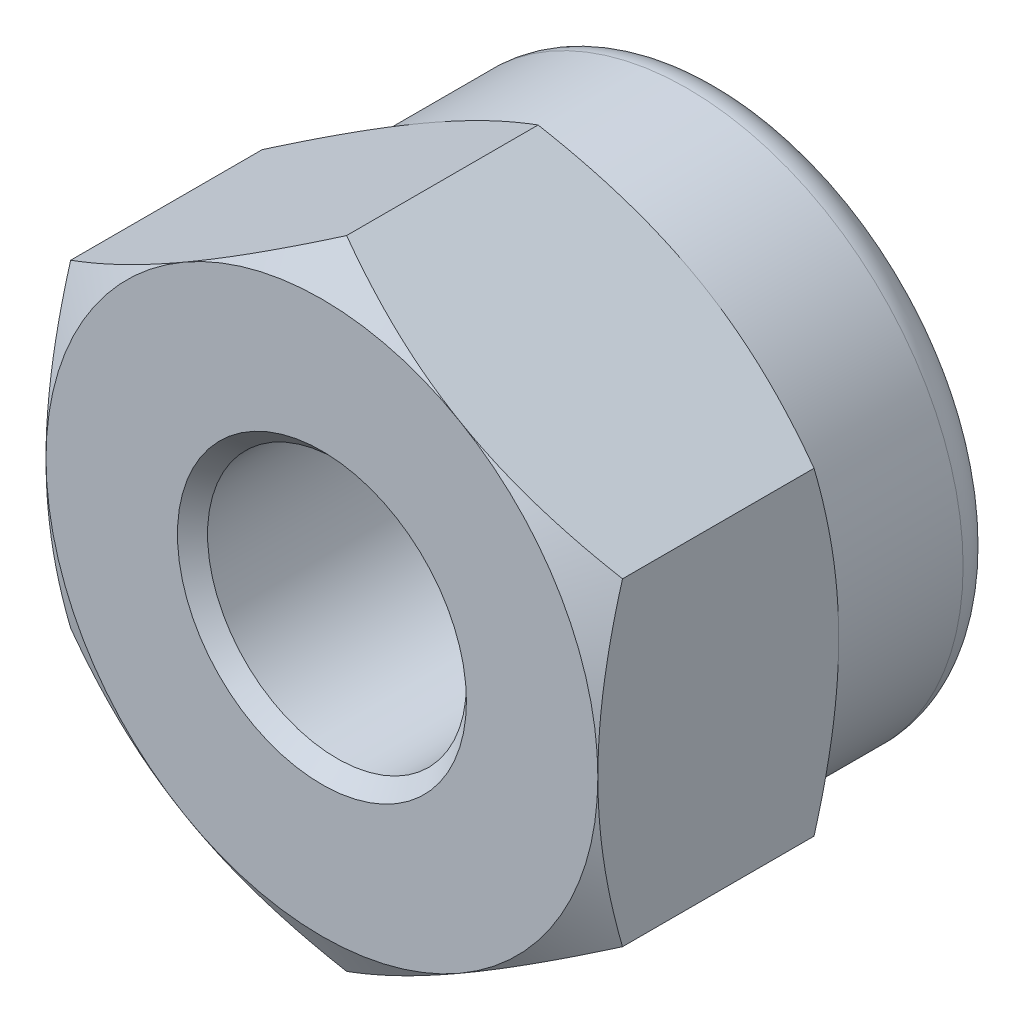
ISO-10303-21;
HEADER;
FILE_DESCRIPTION(('STEP AP214'),'2;1');
FILE_NAME('part.step','',(''),(''),'','','');
FILE_SCHEMA(('AUTOMOTIVE_DESIGN { 1 0 10303 214 1 1 1 1 }'));
ENDSEC;
DATA;
#1=APPLICATION_CONTEXT('core data for automotive mechanical design processes');
#2=APPLICATION_PROTOCOL_DEFINITION('international standard','automotive_design',2000,#1);
#3=PRODUCT_CONTEXT('',#1,'mechanical');
#4=PRODUCT('Part','Part','',(#3));
#5=PRODUCT_RELATED_PRODUCT_CATEGORY('part','',(#4));
#6=PRODUCT_DEFINITION_FORMATION('','',#4);
#7=PRODUCT_DEFINITION_CONTEXT('part definition',#1,'design');
#8=PRODUCT_DEFINITION('design','',#6,#7);
#9=PRODUCT_DEFINITION_SHAPE('','',#8);
#10=(LENGTH_UNIT() NAMED_UNIT(*) SI_UNIT(.MILLI.,.METRE.));
#11=(NAMED_UNIT(*) PLANE_ANGLE_UNIT() SI_UNIT($,.RADIAN.));
#12=(NAMED_UNIT(*) SI_UNIT($,.STERADIAN.) SOLID_ANGLE_UNIT());
#13=UNCERTAINTY_MEASURE_WITH_UNIT(LENGTH_MEASURE(1.E-05),#10,'distance_accuracy_value','');
#14=(GEOMETRIC_REPRESENTATION_CONTEXT(3) GLOBAL_UNCERTAINTY_ASSIGNED_CONTEXT((#13)) GLOBAL_UNIT_ASSIGNED_CONTEXT((#10,
#11,#12)) REPRESENTATION_CONTEXT('',''));
#15=CARTESIAN_POINT('',(0.,0.,0.));
#16=DIRECTION('',(0.,0.,1.));
#17=DIRECTION('',(1.,0.,0.));
#18=AXIS2_PLACEMENT_3D('',#15,#16,#17);
#19=CARTESIAN_POINT('',(0.,0.,-4.));
#20=DIRECTION('',(0.,0.,1.));
#21=DIRECTION('',(1.,0.,0.));
#22=AXIS2_PLACEMENT_3D('',#19,#20,#21);
#23=CYLINDRICAL_SURFACE('',#22,1.65);
#24=CARTESIAN_POINT('',(0.,0.,-2.4));
#25=DIRECTION('',(0.,0.,-1.));
#26=DIRECTION('',(-1.,0.,0.));
#27=AXIS2_PLACEMENT_3D('',#24,#25,#26);
#28=CIRCLE('',#27,1.65);
#29=CARTESIAN_POINT('',(-1.65,0.,-2.4));
#30=VERTEX_POINT('',#29);
#31=EDGE_CURVE('E324',#30,#30,#28,.T.);
#32=ORIENTED_EDGE('',*,*,#31,.F.);
#33=EDGE_LOOP('',(#32));
#34=FACE_BOUND('',#33,.T.);
#35=CARTESIAN_POINT('',(0.,0.,-3.6));
#36=DIRECTION('',(0.,0.,-1.));
#37=DIRECTION('',(-1.,0.,0.));
#38=AXIS2_PLACEMENT_3D('',#35,#36,#37);
#39=CIRCLE('',#38,1.65);
#40=CARTESIAN_POINT('',(-1.65,0.,-3.6));
#41=VERTEX_POINT('',#40);
#42=EDGE_CURVE('E321',#41,#41,#39,.T.);
#43=ORIENTED_EDGE('',*,*,#42,.T.);
#44=EDGE_LOOP('',(#43));
#45=FACE_BOUND('',#44,.T.);
#46=ADVANCED_FACE('F40',(#34,#45),#23,.F.);
#47=CARTESIAN_POINT('',(2.75,1.58771324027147,-2.4));
#48=DIRECTION('',(0.5,0.866025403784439,0.));
#49=DIRECTION('',(-0.866025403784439,0.5,0.));
#50=AXIS2_PLACEMENT_3D('',#47,#48,#49);
#51=PLANE('',#50);
#52=DIRECTION('',(0.,0.,1.));
#53=VECTOR('',#52,1.);
#54=CARTESIAN_POINT('',(2.75,1.58771324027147,-2.4));
#55=LINE('',#54,#53);
#56=CARTESIAN_POINT('',(2.75,1.58771324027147,-2.15437990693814));
#57=VERTEX_POINT('',#56);
#58=CARTESIAN_POINT('',(2.75,1.58771324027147,-0.245620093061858));
#59=VERTEX_POINT('',#58);
#60=EDGE_CURVE('E500',#57,#59,#55,.T.);
#61=ORIENTED_EDGE('',*,*,#60,.F.);
#62=CARTESIAN_POINT('',(2.7502,1.58759777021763,-2.15431323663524));
#63=CARTESIAN_POINT('',(2.62935077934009,1.65737010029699,-2.19461233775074));
#64=CARTESIAN_POINT('',(2.50745839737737,1.72774469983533,-2.23126309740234));
#65=CARTESIAN_POINT('',(2.26156287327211,1.86971254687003,-2.2952378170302));
#66=CARTESIAN_POINT('',(2.13755536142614,1.94130831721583,-2.3225391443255));
#67=CARTESIAN_POINT('',(1.89107720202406,2.08361254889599,-2.36503825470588));
#68=CARTESIAN_POINT('',(1.76864448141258,2.15429911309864,-2.38051888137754));
#69=CARTESIAN_POINT('',(1.52320285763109,2.29600490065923,-2.39900060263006));
#70=CARTESIAN_POINT('',(1.40019484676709,2.36702360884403,-2.4020170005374));
#71=CARTESIAN_POINT('',(1.17034121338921,2.49972966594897,-2.39574685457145));
#72=CARTESIAN_POINT('',(1.06346120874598,2.56143686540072,-2.3879998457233));
#73=CARTESIAN_POINT('',(0.850397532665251,2.68444923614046,-2.36344481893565));
#74=CARTESIAN_POINT('',(0.744214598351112,2.74575398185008,-2.34662841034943));
#75=CARTESIAN_POINT('',(0.530711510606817,2.86902004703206,-2.30458807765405));
#76=CARTESIAN_POINT('',(0.423418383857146,2.93096576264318,-2.27918591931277));
#77=CARTESIAN_POINT('',(0.210432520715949,3.05393320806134,-2.22153277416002));
#78=CARTESIAN_POINT('',(0.104737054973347,3.11495651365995,-2.18929533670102));
#79=CARTESIAN_POINT('',(-0.000200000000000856,3.17554195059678,-2.15431323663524));
#80=B_SPLINE_CURVE_WITH_KNOTS('',3,(#62,#63,#64,#65,#66,#67,#68,#69,#70,#71,#72,#73,#74,#75,#76,
#77,#78,#79),.UNSPECIFIED.,.F.,.F.,(4,2,2,2,2,2,2,2,4),(0.,0.435912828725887,0.87287355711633,
1.29901931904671,1.72464171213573,2.09526089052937,2.46622354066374,2.84541551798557,
3.22386274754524),.UNSPECIFIED.);
#81=CARTESIAN_POINT('',(1.375,2.38156986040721,-2.4));
#82=VERTEX_POINT('',#81);
#83=EDGE_CURVE('E145',#57,#82,#80,.T.);
#84=ORIENTED_EDGE('',*,*,#83,.T.);
#85=CARTESIAN_POINT('',(0.,3.17542648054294,-2.15437990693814));
#86=VERTEX_POINT('',#85);
#87=EDGE_CURVE('E153',#82,#86,#80,.T.);
#88=ORIENTED_EDGE('',*,*,#87,.T.);
#89=DIRECTION('',(0.,0.,1.));
#90=VECTOR('',#89,1.);
#91=CARTESIAN_POINT('',(0.,3.17542648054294,-2.4));
#92=LINE('',#91,#90);
#93=CARTESIAN_POINT('',(0.,3.17542648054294,-0.245620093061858));
#94=VERTEX_POINT('',#93);
#95=EDGE_CURVE('E505',#86,#94,#92,.T.);
#96=ORIENTED_EDGE('',*,*,#95,.T.);
#97=CARTESIAN_POINT('',(-0.000200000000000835,3.17554195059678,-0.245686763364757));
#98=CARTESIAN_POINT('',(0.120649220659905,3.10576962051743,-0.20538766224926));
#99=CARTESIAN_POINT('',(0.242541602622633,3.03539502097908,-0.16873690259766));
#100=CARTESIAN_POINT('',(0.488437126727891,2.89342717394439,-0.104762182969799));
#101=CARTESIAN_POINT('',(0.612444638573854,2.82183140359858,-0.0774608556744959));
#102=CARTESIAN_POINT('',(0.858922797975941,2.67952717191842,-0.0349617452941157));
#103=CARTESIAN_POINT('',(0.981355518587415,2.60884060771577,-0.0194811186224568));
#104=CARTESIAN_POINT('',(1.22679714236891,2.46713482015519,-0.000999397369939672));
#105=CARTESIAN_POINT('',(1.34980515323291,2.39611611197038,0.00201700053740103));
#106=CARTESIAN_POINT('',(1.57965878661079,2.26341005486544,-0.00425314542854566));
#107=CARTESIAN_POINT('',(1.68653879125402,2.20170285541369,-0.0120001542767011));
#108=CARTESIAN_POINT('',(1.89960246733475,2.07869048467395,-0.0365551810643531));
#109=CARTESIAN_POINT('',(2.00578540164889,2.01738573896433,-0.0533715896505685));
#110=CARTESIAN_POINT('',(2.21928848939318,1.89411967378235,-0.0954119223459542));
#111=CARTESIAN_POINT('',(2.32658161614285,1.83217395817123,-0.120814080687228));
#112=CARTESIAN_POINT('',(2.53956747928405,1.70920651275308,-0.178467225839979));
#113=CARTESIAN_POINT('',(2.64526294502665,1.64818320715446,-0.210704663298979));
#114=CARTESIAN_POINT('',(2.7502,1.58759777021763,-0.245686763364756));
#115=B_SPLINE_CURVE_WITH_KNOTS('',3,(#97,#98,#99,#100,#101,#102,#103,#104,#105,#106,#107,#108,
#109,#110,#111,#112,#113,#114),.UNSPECIFIED.,.F.,.F.,(4,2,2,2,2,2,2,2,4),(0.,0.435912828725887,
0.87287355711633,1.29901931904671,1.72464171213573,2.09526089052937,2.46622354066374,
2.84541551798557,3.22386274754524),.UNSPECIFIED.);
#116=CARTESIAN_POINT('',(1.375,2.38156986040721,0.));
#117=VERTEX_POINT('',#116);
#118=EDGE_CURVE('E504',#94,#117,#115,.T.);
#119=ORIENTED_EDGE('',*,*,#118,.T.);
#120=EDGE_CURVE('E241',#117,#59,#115,.T.);
#121=ORIENTED_EDGE('',*,*,#120,.T.);
#122=EDGE_LOOP('',(#61,#84,#88,#96,#119,#121));
#123=FACE_BOUND('',#122,.T.);
#124=ADVANCED_FACE('F252',(#123),#51,.T.);
#125=CARTESIAN_POINT('',(2.75,-1.58771324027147,-2.4));
#126=DIRECTION('',(1.,0.,0.));
#127=DIRECTION('',(0.,0.,-1.));
#128=AXIS2_PLACEMENT_3D('',#125,#126,#127);
#129=PLANE('',#128);
#130=DIRECTION('',(0.,0.,1.));
#131=VECTOR('',#130,1.);
#132=CARTESIAN_POINT('',(2.75,-1.58771324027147,-2.4));
#133=LINE('',#132,#131);
#134=CARTESIAN_POINT('',(2.75,-1.58771324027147,-2.15437990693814));
#135=VERTEX_POINT('',#134);
#136=CARTESIAN_POINT('',(2.75,-1.58771324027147,-0.245620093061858));
#137=VERTEX_POINT('',#136);
#138=EDGE_CURVE('E301',#135,#137,#133,.T.);
#139=ORIENTED_EDGE('',*,*,#138,.F.);
#140=CARTESIAN_POINT('',(2.75,-4.21084949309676,-1.08405156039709));
#141=CARTESIAN_POINT('',(2.75,-4.0901089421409,-1.14240006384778));
#142=CARTESIAN_POINT('',(2.75,-3.96908292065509,-1.20016853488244));
#143=CARTESIAN_POINT('',(2.75,-3.72630558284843,-1.31421396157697));
#144=CARTESIAN_POINT('',(2.75,-3.604554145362,-1.37049065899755));
#145=CARTESIAN_POINT('',(2.75,-3.35951393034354,-1.48151755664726));
#146=CARTESIAN_POINT('',(2.75,-3.23622034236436,-1.53625717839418));
#147=CARTESIAN_POINT('',(2.75,-2.98861980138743,-1.64338522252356));
#148=CARTESIAN_POINT('',(2.75,-2.86431290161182,-1.69577376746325));
#149=CARTESIAN_POINT('',(2.75,-2.61294485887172,-1.79819642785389));
#150=CARTESIAN_POINT('',(2.75,-2.48586863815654,-1.84819374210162));
#151=CARTESIAN_POINT('',(2.75,-2.2302173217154,-1.94427259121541));
#152=CARTESIAN_POINT('',(2.75,-2.10164206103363,-1.99035369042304));
#153=CARTESIAN_POINT('',(2.75,-1.84305218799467,-2.07736192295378));
#154=CARTESIAN_POINT('',(2.75,-1.71304130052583,-2.11830001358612));
#155=CARTESIAN_POINT('',(2.75,-1.45117125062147,-2.19369269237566));
#156=CARTESIAN_POINT('',(2.75,-1.31931268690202,-2.22814933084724));
#157=CARTESIAN_POINT('',(2.75,-1.05365722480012,-2.2889063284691));
#158=CARTESIAN_POINT('',(2.75,-0.91985982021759,-2.31520451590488));
#159=CARTESIAN_POINT('',(2.75,-0.650651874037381,-2.35787396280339));
#160=CARTESIAN_POINT('',(2.75,-0.515241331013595,-2.37424521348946));
#161=CARTESIAN_POINT('',(2.75,-0.244373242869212,-2.39561250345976));
#162=CARTESIAN_POINT('',(2.75,-0.108921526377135,-2.40068055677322));
#163=CARTESIAN_POINT('',(2.75,0.161887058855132,-2.39917220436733));
#164=CARTESIAN_POINT('',(2.75,0.297243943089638,-2.39259882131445));
#165=CARTESIAN_POINT('',(2.75,0.528385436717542,-2.37189586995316));
#166=CARTESIAN_POINT('',(2.75,0.624425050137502,-2.36046235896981));
#167=CARTESIAN_POINT('',(2.75,0.815762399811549,-2.33247828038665));
#168=CARTESIAN_POINT('',(2.75,0.911060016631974,-2.31592690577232));
#169=CARTESIAN_POINT('',(2.75,1.19576218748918,-2.25946463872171));
#170=CARTESIAN_POINT('',(2.75,1.38383224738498,-2.2127601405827));
#171=CARTESIAN_POINT('',(2.75,1.66525048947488,-2.13220750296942));
#172=CARTESIAN_POINT('',(2.75,1.7600655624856,-2.1031966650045));
#173=CARTESIAN_POINT('',(2.75,1.94870609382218,-2.04230435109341));
#174=CARTESIAN_POINT('',(2.75,2.04253218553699,-2.01042485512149));
#175=CARTESIAN_POINT('',(2.75,2.22880240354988,-1.94445858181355));
#176=CARTESIAN_POINT('',(2.75,2.32125133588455,-1.91038523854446));
#177=CARTESIAN_POINT('',(2.75,2.50543192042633,-1.84023863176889));
#178=CARTESIAN_POINT('',(2.75,2.59716326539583,-1.80416455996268));
#179=CARTESIAN_POINT('',(2.75,2.6885629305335,-1.76728755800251));
#180=B_SPLINE_CURVE_WITH_KNOTS('',3,(#140,#141,#142,#143,#144,#145,#146,#147,#148,#149,#150,
#151,#152,#153,#154,#155,#156,#157,#158,#159,#160,#161,#162,#163,#164,#165,#166,#167,#168,#169,
#170,#171,#172,#173,#174,#175,#176,#177,#178,#179),.UNSPECIFIED.,.F.,.F.,(4,2,2,2,2,2,2,2,2,2,2,
2,2,2,2,2,2,2,2,4),(0.,0.402305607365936,0.804680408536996,1.20935783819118,1.61401414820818,
2.02363838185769,2.43330812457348,2.842089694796,3.25074173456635,3.65950246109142,
4.06826354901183,4.47441284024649,4.8804566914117,5.17046846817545,5.46052599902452,
6.04107275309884,6.33851131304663,6.63574613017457,6.93130791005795,7.22698998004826),.UNSPECIFIED.);
#181=CARTESIAN_POINT('',(2.75,0.,-2.4));
#182=VERTEX_POINT('',#181);
#183=EDGE_CURVE('E265',#135,#182,#180,.T.);
#184=ORIENTED_EDGE('',*,*,#183,.T.);
#185=EDGE_CURVE('E258',#182,#57,#180,.T.);
#186=ORIENTED_EDGE('',*,*,#185,.T.);
#187=ORIENTED_EDGE('',*,*,#60,.T.);
#188=CARTESIAN_POINT('',(2.75,-4.21084949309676,-1.31594843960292));
#189=CARTESIAN_POINT('',(2.75,-4.0901089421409,-1.25759993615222));
#190=CARTESIAN_POINT('',(2.75,-3.96908292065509,-1.19983146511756));
#191=CARTESIAN_POINT('',(2.75,-3.72630558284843,-1.08578603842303));
#192=CARTESIAN_POINT('',(2.75,-3.604554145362,-1.02950934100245));
#193=CARTESIAN_POINT('',(2.75,-3.35951393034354,-0.918482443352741));
#194=CARTESIAN_POINT('',(2.75,-3.23622034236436,-0.863742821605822));
#195=CARTESIAN_POINT('',(2.75,-2.98861980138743,-0.75661477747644));
#196=CARTESIAN_POINT('',(2.75,-2.86431290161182,-0.704226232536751));
#197=CARTESIAN_POINT('',(2.75,-2.61294485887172,-0.601803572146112));
#198=CARTESIAN_POINT('',(2.75,-2.48586863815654,-0.551806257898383));
#199=CARTESIAN_POINT('',(2.75,-2.2302173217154,-0.455727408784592));
#200=CARTESIAN_POINT('',(2.75,-2.10164206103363,-0.409646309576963));
#201=CARTESIAN_POINT('',(2.75,-1.84305218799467,-0.322638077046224));
#202=CARTESIAN_POINT('',(2.75,-1.71304130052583,-0.281699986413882));
#203=CARTESIAN_POINT('',(2.75,-1.45117125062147,-0.206307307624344));
#204=CARTESIAN_POINT('',(2.75,-1.31931268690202,-0.171850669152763));
#205=CARTESIAN_POINT('',(2.75,-1.05365722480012,-0.111093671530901));
#206=CARTESIAN_POINT('',(2.75,-0.91985982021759,-0.0847954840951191));
#207=CARTESIAN_POINT('',(2.75,-0.65065187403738,-0.0421260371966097));
#208=CARTESIAN_POINT('',(2.75,-0.515241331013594,-0.025754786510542));
#209=CARTESIAN_POINT('',(2.75,-0.244373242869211,-0.00438749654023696));
#210=CARTESIAN_POINT('',(2.75,-0.108921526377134,0.000680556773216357));
#211=CARTESIAN_POINT('',(2.75,0.161887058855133,-0.000827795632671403));
#212=CARTESIAN_POINT('',(2.75,0.297243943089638,-0.00740117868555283));
#213=CARTESIAN_POINT('',(2.75,0.528385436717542,-0.0281041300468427));
#214=CARTESIAN_POINT('',(2.75,0.624425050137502,-0.0395376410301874));
#215=CARTESIAN_POINT('',(2.75,0.815762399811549,-0.0675217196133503));
#216=CARTESIAN_POINT('',(2.75,0.911060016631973,-0.0840730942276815));
#217=CARTESIAN_POINT('',(2.75,1.19576218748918,-0.140535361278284));
#218=CARTESIAN_POINT('',(2.75,1.38383224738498,-0.187239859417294));
#219=CARTESIAN_POINT('',(2.75,1.66525048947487,-0.26779249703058));
#220=CARTESIAN_POINT('',(2.75,1.7600655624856,-0.296803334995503));
#221=CARTESIAN_POINT('',(2.75,1.94870609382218,-0.357695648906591));
#222=CARTESIAN_POINT('',(2.75,2.04253218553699,-0.389575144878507));
#223=CARTESIAN_POINT('',(2.75,2.22880240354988,-0.455541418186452));
#224=CARTESIAN_POINT('',(2.75,2.32125133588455,-0.489614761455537));
#225=CARTESIAN_POINT('',(2.75,2.50543192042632,-0.559761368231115));
#226=CARTESIAN_POINT('',(2.75,2.59716326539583,-0.595835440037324));
#227=CARTESIAN_POINT('',(2.75,2.6885629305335,-0.63271244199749));
#228=B_SPLINE_CURVE_WITH_KNOTS('',3,(#188,#189,#190,#191,#192,#193,#194,#195,#196,#197,#198,
#199,#200,#201,#202,#203,#204,#205,#206,#207,#208,#209,#210,#211,#212,#213,#214,#215,#216,#217,
#218,#219,#220,#221,#222,#223,#224,#225,#226,#227),.UNSPECIFIED.,.F.,.F.,(4,2,2,2,2,2,2,2,2,2,2,
2,2,2,2,2,2,2,2,4),(0.,0.402305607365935,0.804680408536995,1.20935783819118,1.61401414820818,
2.02363838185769,2.43330812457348,2.842089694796,3.25074173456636,3.65950246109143,
4.06826354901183,4.47441284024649,4.88045669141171,5.17046846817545,5.46052599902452,
6.04107275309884,6.33851131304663,6.63574613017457,6.93130791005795,7.22698998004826),.UNSPECIFIED.);
#229=CARTESIAN_POINT('',(2.75,0.,0.));
#230=VERTEX_POINT('',#229);
#231=EDGE_CURVE('E239',#59,#230,#228,.F.);
#232=ORIENTED_EDGE('',*,*,#231,.T.);
#233=EDGE_CURVE('E232',#230,#137,#228,.F.);
#234=ORIENTED_EDGE('',*,*,#233,.T.);
#235=EDGE_LOOP('',(#139,#184,#186,#187,#232,#234));
#236=FACE_BOUND('',#235,.T.);
#237=ADVANCED_FACE('F247',(#236),#129,.T.);
#238=CARTESIAN_POINT('',(0.,-3.17542648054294,-2.4));
#239=DIRECTION('',(0.5,-0.866025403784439,0.));
#240=DIRECTION('',(0.866025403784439,0.5,0.));
#241=AXIS2_PLACEMENT_3D('',#238,#239,#240);
#242=PLANE('',#241);
#243=DIRECTION('',(0.,0.,1.));
#244=VECTOR('',#243,1.);
#245=CARTESIAN_POINT('',(0.,-3.17542648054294,-2.4));
#246=LINE('',#245,#244);
#247=CARTESIAN_POINT('',(0.,-3.17542648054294,-2.15437990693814));
#248=VERTEX_POINT('',#247);
#249=CARTESIAN_POINT('',(0.,-3.17542648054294,-0.245620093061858));
#250=VERTEX_POINT('',#249);
#251=EDGE_CURVE('E291',#248,#250,#246,.T.);
#252=ORIENTED_EDGE('',*,*,#251,.F.);
#253=CARTESIAN_POINT('',(-0.000200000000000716,-3.17554195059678,-2.15431323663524));
#254=CARTESIAN_POINT('',(0.120649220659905,-3.10576962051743,-2.19461233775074));
#255=CARTESIAN_POINT('',(0.242541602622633,-3.03539502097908,-2.23126309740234));
#256=CARTESIAN_POINT('',(0.488437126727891,-2.89342717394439,-2.2952378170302));
#257=CARTESIAN_POINT('',(0.612444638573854,-2.82183140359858,-2.3225391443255));
#258=CARTESIAN_POINT('',(0.858922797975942,-2.67952717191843,-2.36503825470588));
#259=CARTESIAN_POINT('',(0.981355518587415,-2.60884060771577,-2.38051888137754));
#260=CARTESIAN_POINT('',(1.22679714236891,-2.46713482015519,-2.39900060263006));
#261=CARTESIAN_POINT('',(1.34980515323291,-2.39611611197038,-2.4020170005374));
#262=CARTESIAN_POINT('',(1.57965878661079,-2.26341005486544,-2.39574685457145));
#263=CARTESIAN_POINT('',(1.68653879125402,-2.20170285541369,-2.3879998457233));
#264=CARTESIAN_POINT('',(1.89960246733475,-2.07869048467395,-2.36344481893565));
#265=CARTESIAN_POINT('',(2.00578540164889,-2.01738573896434,-2.34662841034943));
#266=CARTESIAN_POINT('',(2.21928848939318,-1.89411967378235,-2.30458807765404));
#267=CARTESIAN_POINT('',(2.32658161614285,-1.83217395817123,-2.27918591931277));
#268=CARTESIAN_POINT('',(2.53956747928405,-1.70920651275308,-2.22153277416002));
#269=CARTESIAN_POINT('',(2.64526294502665,-1.64818320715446,-2.18929533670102));
#270=CARTESIAN_POINT('',(2.7502,-1.58759777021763,-2.15431323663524));
#271=B_SPLINE_CURVE_WITH_KNOTS('',3,(#253,#254,#255,#256,#257,#258,#259,#260,#261,#262,#263,
#264,#265,#266,#267,#268,#269,#270),.UNSPECIFIED.,.F.,.F.,(4,2,2,2,2,2,2,2,4),(0.,
0.435912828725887,0.87287355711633,1.29901931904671,1.72464171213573,2.09526089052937,
2.46622354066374,2.84541551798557,3.22386274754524),.UNSPECIFIED.);
#272=CARTESIAN_POINT('',(1.375,-2.38156986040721,-2.4));
#273=VERTEX_POINT('',#272);
#274=EDGE_CURVE('E276',#248,#273,#271,.T.);
#275=ORIENTED_EDGE('',*,*,#274,.T.);
#276=EDGE_CURVE('E270',#273,#135,#271,.T.);
#277=ORIENTED_EDGE('',*,*,#276,.T.);
#278=ORIENTED_EDGE('',*,*,#138,.T.);
#279=CARTESIAN_POINT('',(2.7502,-1.58759777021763,-0.245686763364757));
#280=CARTESIAN_POINT('',(2.62935077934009,-1.65737010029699,-0.20538766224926));
#281=CARTESIAN_POINT('',(2.50745839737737,-1.72774469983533,-0.168736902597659));
#282=CARTESIAN_POINT('',(2.26156287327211,-1.86971254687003,-0.104762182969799));
#283=CARTESIAN_POINT('',(2.13755536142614,-1.94130831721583,-0.0774608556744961));
#284=CARTESIAN_POINT('',(1.89107720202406,-2.08361254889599,-0.0349617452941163));
#285=CARTESIAN_POINT('',(1.76864448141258,-2.15429911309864,-0.0194811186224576));
#286=CARTESIAN_POINT('',(1.52320285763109,-2.29600490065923,-0.000999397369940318));
#287=CARTESIAN_POINT('',(1.40019484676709,-2.36702360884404,0.00201700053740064));
#288=CARTESIAN_POINT('',(1.17034121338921,-2.49972966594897,-0.00425314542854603));
#289=CARTESIAN_POINT('',(1.06346120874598,-2.56143686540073,-0.0120001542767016));
#290=CARTESIAN_POINT('',(0.850397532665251,-2.68444923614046,-0.0365551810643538));
#291=CARTESIAN_POINT('',(0.744214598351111,-2.74575398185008,-0.0533715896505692));
#292=CARTESIAN_POINT('',(0.530711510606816,-2.86902004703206,-0.0954119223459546));
#293=CARTESIAN_POINT('',(0.423418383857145,-2.93096576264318,-0.120814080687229));
#294=CARTESIAN_POINT('',(0.210432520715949,-3.05393320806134,-0.178467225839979));
#295=CARTESIAN_POINT('',(0.104737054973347,-3.11495651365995,-0.210704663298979));
#296=CARTESIAN_POINT('',(-0.000200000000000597,-3.17554195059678,-0.245686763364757));
#297=B_SPLINE_CURVE_WITH_KNOTS('',3,(#279,#280,#281,#282,#283,#284,#285,#286,#287,#288,#289,
#290,#291,#292,#293,#294,#295,#296),.UNSPECIFIED.,.F.,.F.,(4,2,2,2,2,2,2,2,4),(0.,
0.435912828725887,0.87287355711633,1.29901931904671,1.72464171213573,2.09526089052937,
2.46622354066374,2.84541551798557,3.22386274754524),.UNSPECIFIED.);
#298=CARTESIAN_POINT('',(1.375,-2.38156986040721,0.));
#299=VERTEX_POINT('',#298);
#300=EDGE_CURVE('E240',#137,#299,#297,.T.);
#301=ORIENTED_EDGE('',*,*,#300,.T.);
#302=EDGE_CURVE('E226',#299,#250,#297,.T.);
#303=ORIENTED_EDGE('',*,*,#302,.T.);
#304=EDGE_LOOP('',(#252,#275,#277,#278,#301,#303));
#305=FACE_BOUND('',#304,.T.);
#306=ADVANCED_FACE('F251',(#305),#242,.T.);
#307=CARTESIAN_POINT('',(-2.75,-1.58771324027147,-2.4));
#308=DIRECTION('',(-0.5,-0.866025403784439,0.));
#309=DIRECTION('',(0.866025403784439,-0.5,0.));
#310=AXIS2_PLACEMENT_3D('',#307,#308,#309);
#311=PLANE('',#310);
#312=DIRECTION('',(0.,0.,1.));
#313=VECTOR('',#312,1.);
#314=CARTESIAN_POINT('',(-2.75,-1.58771324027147,-2.4));
#315=LINE('',#314,#313);
#316=CARTESIAN_POINT('',(-2.75,-1.58771324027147,-2.15437990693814));
#317=VERTEX_POINT('',#316);
#318=CARTESIAN_POINT('',(-2.75,-1.58771324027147,-0.245620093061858));
#319=VERTEX_POINT('',#318);
#320=EDGE_CURVE('E509',#317,#319,#315,.T.);
#321=ORIENTED_EDGE('',*,*,#320,.F.);
#322=CARTESIAN_POINT('',(-2.7502,-1.58759777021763,-2.15431323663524));
#323=CARTESIAN_POINT('',(-2.62935077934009,-1.65737010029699,-2.19461233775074));
#324=CARTESIAN_POINT('',(-2.50745839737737,-1.72774469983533,-2.23126309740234));
#325=CARTESIAN_POINT('',(-2.26156287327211,-1.86971254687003,-2.2952378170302));
#326=CARTESIAN_POINT('',(-2.13755536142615,-1.94130831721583,-2.3225391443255));
#327=CARTESIAN_POINT('',(-1.89107720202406,-2.08361254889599,-2.36503825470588));
#328=CARTESIAN_POINT('',(-1.76864448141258,-2.15429911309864,-2.38051888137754));
#329=CARTESIAN_POINT('',(-1.52320285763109,-2.29600490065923,-2.39900060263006));
#330=CARTESIAN_POINT('',(-1.40019484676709,-2.36702360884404,-2.4020170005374));
#331=CARTESIAN_POINT('',(-1.17034121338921,-2.49972966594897,-2.39574685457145));
#332=CARTESIAN_POINT('',(-1.06346120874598,-2.56143686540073,-2.3879998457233));
#333=CARTESIAN_POINT('',(-0.850397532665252,-2.68444923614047,-2.36344481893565));
#334=CARTESIAN_POINT('',(-0.744214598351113,-2.74575398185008,-2.34662841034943));
#335=CARTESIAN_POINT('',(-0.530711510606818,-2.86902004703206,-2.30458807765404));
#336=CARTESIAN_POINT('',(-0.423418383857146,-2.93096576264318,-2.27918591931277));
#337=CARTESIAN_POINT('',(-0.21043252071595,-3.05393320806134,-2.22153277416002));
#338=CARTESIAN_POINT('',(-0.104737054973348,-3.11495651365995,-2.18929533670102));
#339=CARTESIAN_POINT('',(0.000199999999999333,-3.17554195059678,-2.15431323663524));
#340=B_SPLINE_CURVE_WITH_KNOTS('',3,(#322,#323,#324,#325,#326,#327,#328,#329,#330,#331,#332,
#333,#334,#335,#336,#337,#338,#339),.UNSPECIFIED.,.F.,.F.,(4,2,2,2,2,2,2,2,4),(0.,
0.435912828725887,0.87287355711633,1.29901931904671,1.72464171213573,2.09526089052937,
2.46622354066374,2.84541551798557,3.22386274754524),.UNSPECIFIED.);
#341=CARTESIAN_POINT('',(-1.375,-2.38156986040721,-2.4));
#342=VERTEX_POINT('',#341);
#343=EDGE_CURVE('E142',#317,#342,#340,.T.);
#344=ORIENTED_EDGE('',*,*,#343,.T.);
#345=EDGE_CURVE('E277',#342,#248,#340,.T.);
#346=ORIENTED_EDGE('',*,*,#345,.T.);
#347=ORIENTED_EDGE('',*,*,#251,.T.);
#348=CARTESIAN_POINT('',(0.000199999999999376,-3.17554195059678,-0.245686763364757));
#349=CARTESIAN_POINT('',(-0.120649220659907,-3.10576962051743,-0.20538766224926));
#350=CARTESIAN_POINT('',(-0.242541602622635,-3.03539502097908,-0.16873690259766));
#351=CARTESIAN_POINT('',(-0.488437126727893,-2.89342717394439,-0.104762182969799));
#352=CARTESIAN_POINT('',(-0.612444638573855,-2.82183140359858,-0.0774608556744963));
#353=CARTESIAN_POINT('',(-0.858922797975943,-2.67952717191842,-0.0349617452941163));
#354=CARTESIAN_POINT('',(-0.981355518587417,-2.60884060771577,-0.0194811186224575));
#355=CARTESIAN_POINT('',(-1.22679714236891,-2.46713482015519,-0.000999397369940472));
#356=CARTESIAN_POINT('',(-1.34980515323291,-2.39611611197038,0.00201700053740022));
#357=CARTESIAN_POINT('',(-1.57965878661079,-2.26341005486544,-0.00425314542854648));
#358=CARTESIAN_POINT('',(-1.68653879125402,-2.20170285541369,-0.0120001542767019));
#359=CARTESIAN_POINT('',(-1.89960246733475,-2.07869048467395,-0.0365551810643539));
#360=CARTESIAN_POINT('',(-2.00578540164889,-2.01738573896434,-0.0533715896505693));
#361=CARTESIAN_POINT('',(-2.21928848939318,-1.89411967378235,-0.0954119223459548));
#362=CARTESIAN_POINT('',(-2.32658161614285,-1.83217395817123,-0.120814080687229));
#363=CARTESIAN_POINT('',(-2.53956747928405,-1.70920651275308,-0.178467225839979));
#364=CARTESIAN_POINT('',(-2.64526294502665,-1.64818320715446,-0.210704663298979));
#365=CARTESIAN_POINT('',(-2.7502,-1.58759777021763,-0.245686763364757));
#366=B_SPLINE_CURVE_WITH_KNOTS('',3,(#348,#349,#350,#351,#352,#353,#354,#355,#356,#357,#358,
#359,#360,#361,#362,#363,#364,#365),.UNSPECIFIED.,.F.,.F.,(4,2,2,2,2,2,2,2,4),(0.,
0.435912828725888,0.87287355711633,1.29901931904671,1.72464171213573,2.09526089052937,
2.46622354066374,2.84541551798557,3.22386274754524),.UNSPECIFIED.);
#367=CARTESIAN_POINT('',(-1.375,-2.38156986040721,0.));
#368=VERTEX_POINT('',#367);
#369=EDGE_CURVE('E514',#250,#368,#366,.T.);
#370=ORIENTED_EDGE('',*,*,#369,.T.);
#371=EDGE_CURVE('E205',#368,#319,#366,.T.);
#372=ORIENTED_EDGE('',*,*,#371,.T.);
#373=EDGE_LOOP('',(#321,#344,#346,#347,#370,#372));
#374=FACE_BOUND('',#373,.T.);
#375=ADVANCED_FACE('F184',(#374),#311,.T.);
#376=CARTESIAN_POINT('',(-2.75,1.58771324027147,-2.4));
#377=DIRECTION('',(-1.,0.,0.));
#378=DIRECTION('',(0.,-1.,0.));
#379=AXIS2_PLACEMENT_3D('',#376,#377,#378);
#380=PLANE('',#379);
#381=DIRECTION('',(0.,0.,1.));
#382=VECTOR('',#381,1.);
#383=CARTESIAN_POINT('',(-2.75,1.58771324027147,-2.4));
#384=LINE('',#383,#382);
#385=CARTESIAN_POINT('',(-2.75,1.58771324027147,-2.15437990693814));
#386=VERTEX_POINT('',#385);
#387=CARTESIAN_POINT('',(-2.75,1.58771324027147,-0.245620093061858));
#388=VERTEX_POINT('',#387);
#389=EDGE_CURVE('E152',#386,#388,#384,.T.);
#390=ORIENTED_EDGE('',*,*,#389,.F.);
#391=CARTESIAN_POINT('',(-2.75,-4.21084949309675,-1.08405156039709));
#392=CARTESIAN_POINT('',(-2.75,-4.09010894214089,-1.14240006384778));
#393=CARTESIAN_POINT('',(-2.75,-3.96908292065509,-1.20016853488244));
#394=CARTESIAN_POINT('',(-2.75,-3.72630558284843,-1.31421396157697));
#395=CARTESIAN_POINT('',(-2.75,-3.604554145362,-1.37049065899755));
#396=CARTESIAN_POINT('',(-2.75,-3.35951393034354,-1.48151755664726));
#397=CARTESIAN_POINT('',(-2.75,-3.23622034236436,-1.53625717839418));
#398=CARTESIAN_POINT('',(-2.75,-2.98861980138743,-1.64338522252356));
#399=CARTESIAN_POINT('',(-2.75,-2.86431290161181,-1.69577376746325));
#400=CARTESIAN_POINT('',(-2.75,-2.61294485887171,-1.79819642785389));
#401=CARTESIAN_POINT('',(-2.75,-2.48586863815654,-1.84819374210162));
#402=CARTESIAN_POINT('',(-2.75,-2.2302173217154,-1.94427259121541));
#403=CARTESIAN_POINT('',(-2.75,-2.10164206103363,-1.99035369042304));
#404=CARTESIAN_POINT('',(-2.75,-1.84305218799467,-2.07736192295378));
#405=CARTESIAN_POINT('',(-2.75,-1.71304130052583,-2.11830001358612));
#406=CARTESIAN_POINT('',(-2.75,-1.45117125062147,-2.19369269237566));
#407=CARTESIAN_POINT('',(-2.75,-1.31931268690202,-2.22814933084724));
#408=CARTESIAN_POINT('',(-2.75,-1.05365722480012,-2.2889063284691));
#409=CARTESIAN_POINT('',(-2.75,-0.919859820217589,-2.31520451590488));
#410=CARTESIAN_POINT('',(-2.75,-0.65065187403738,-2.35787396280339));
#411=CARTESIAN_POINT('',(-2.75,-0.515241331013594,-2.37424521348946));
#412=CARTESIAN_POINT('',(-2.75,-0.244373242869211,-2.39561250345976));
#413=CARTESIAN_POINT('',(-2.75,-0.108921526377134,-2.40068055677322));
#414=CARTESIAN_POINT('',(-2.75,0.161887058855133,-2.39917220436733));
#415=CARTESIAN_POINT('',(-2.75,0.297243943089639,-2.39259882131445));
#416=CARTESIAN_POINT('',(-2.75,0.528385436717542,-2.37189586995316));
#417=CARTESIAN_POINT('',(-2.75,0.624425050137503,-2.36046235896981));
#418=CARTESIAN_POINT('',(-2.75,0.81576239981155,-2.33247828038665));
#419=CARTESIAN_POINT('',(-2.75,0.911060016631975,-2.31592690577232));
#420=CARTESIAN_POINT('',(-2.75,1.19576218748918,-2.25946463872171));
#421=CARTESIAN_POINT('',(-2.75,1.38383224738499,-2.2127601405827));
#422=CARTESIAN_POINT('',(-2.75,1.66525048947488,-2.13220750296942));
#423=CARTESIAN_POINT('',(-2.75,1.76006556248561,-2.1031966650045));
#424=CARTESIAN_POINT('',(-2.75,1.94870609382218,-2.04230435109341));
#425=CARTESIAN_POINT('',(-2.75,2.04253218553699,-2.01042485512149));
#426=CARTESIAN_POINT('',(-2.75,2.22880240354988,-1.94445858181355));
#427=CARTESIAN_POINT('',(-2.75,2.32125133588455,-1.91038523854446));
#428=CARTESIAN_POINT('',(-2.75,2.50543192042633,-1.84023863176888));
#429=CARTESIAN_POINT('',(-2.75,2.59716326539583,-1.80416455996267));
#430=CARTESIAN_POINT('',(-2.75,2.6885629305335,-1.76728755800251));
#431=B_SPLINE_CURVE_WITH_KNOTS('',3,(#391,#392,#393,#394,#395,#396,#397,#398,#399,#400,#401,
#402,#403,#404,#405,#406,#407,#408,#409,#410,#411,#412,#413,#414,#415,#416,#417,#418,#419,#420,
#421,#422,#423,#424,#425,#426,#427,#428,#429,#430),.UNSPECIFIED.,.F.,.F.,(4,2,2,2,2,2,2,2,2,2,2,
2,2,2,2,2,2,2,2,4),(0.,0.402305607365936,0.804680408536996,1.20935783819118,1.61401414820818,
2.0236383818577,2.43330812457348,2.842089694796,3.25074173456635,3.65950246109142,
4.06826354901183,4.47441284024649,4.8804566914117,5.17046846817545,5.46052599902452,
6.04107275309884,6.33851131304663,6.63574613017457,6.93130791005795,7.22698998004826),.UNSPECIFIED.);
#432=CARTESIAN_POINT('',(-2.75,0.,-2.4));
#433=VERTEX_POINT('',#432);
#434=EDGE_CURVE('E63',#386,#433,#431,.F.);
#435=ORIENTED_EDGE('',*,*,#434,.T.);
#436=EDGE_CURVE('E140',#433,#317,#431,.F.);
#437=ORIENTED_EDGE('',*,*,#436,.T.);
#438=ORIENTED_EDGE('',*,*,#320,.T.);
#439=CARTESIAN_POINT('',(-2.75,-4.21084949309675,-1.31594843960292));
#440=CARTESIAN_POINT('',(-2.75,-4.09010894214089,-1.25759993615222));
#441=CARTESIAN_POINT('',(-2.75,-3.96908292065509,-1.19983146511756));
#442=CARTESIAN_POINT('',(-2.75,-3.72630558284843,-1.08578603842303));
#443=CARTESIAN_POINT('',(-2.75,-3.604554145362,-1.02950934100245));
#444=CARTESIAN_POINT('',(-2.75,-3.35951393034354,-0.91848244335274));
#445=CARTESIAN_POINT('',(-2.75,-3.23622034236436,-0.863742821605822));
#446=CARTESIAN_POINT('',(-2.75,-2.98861980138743,-0.756614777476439));
#447=CARTESIAN_POINT('',(-2.75,-2.86431290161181,-0.70422623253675));
#448=CARTESIAN_POINT('',(-2.75,-2.61294485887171,-0.601803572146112));
#449=CARTESIAN_POINT('',(-2.75,-2.48586863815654,-0.551806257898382));
#450=CARTESIAN_POINT('',(-2.75,-2.2302173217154,-0.455727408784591));
#451=CARTESIAN_POINT('',(-2.75,-2.10164206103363,-0.409646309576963));
#452=CARTESIAN_POINT('',(-2.75,-1.84305218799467,-0.322638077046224));
#453=CARTESIAN_POINT('',(-2.75,-1.71304130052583,-0.281699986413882));
#454=CARTESIAN_POINT('',(-2.75,-1.45117125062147,-0.206307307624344));
#455=CARTESIAN_POINT('',(-2.75,-1.31931268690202,-0.171850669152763));
#456=CARTESIAN_POINT('',(-2.75,-1.05365722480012,-0.111093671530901));
#457=CARTESIAN_POINT('',(-2.75,-0.919859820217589,-0.0847954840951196));
#458=CARTESIAN_POINT('',(-2.75,-0.65065187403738,-0.0421260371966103));
#459=CARTESIAN_POINT('',(-2.75,-0.515241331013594,-0.0257547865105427));
#460=CARTESIAN_POINT('',(-2.75,-0.244373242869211,-0.00438749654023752));
#461=CARTESIAN_POINT('',(-2.75,-0.108921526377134,0.000680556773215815));
#462=CARTESIAN_POINT('',(-2.75,0.161887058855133,-0.000827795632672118));
#463=CARTESIAN_POINT('',(-2.75,0.297243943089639,-0.00740117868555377));
#464=CARTESIAN_POINT('',(-2.75,0.528385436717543,-0.0281041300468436));
#465=CARTESIAN_POINT('',(-2.75,0.624425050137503,-0.039537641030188));
#466=CARTESIAN_POINT('',(-2.75,0.81576239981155,-0.067521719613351));
#467=CARTESIAN_POINT('',(-2.75,0.911060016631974,-0.0840730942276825));
#468=CARTESIAN_POINT('',(-2.75,1.19576218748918,-0.140535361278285));
#469=CARTESIAN_POINT('',(-2.75,1.38383224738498,-0.187239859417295));
#470=CARTESIAN_POINT('',(-2.75,1.66525048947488,-0.267792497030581));
#471=CARTESIAN_POINT('',(-2.75,1.7600655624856,-0.296803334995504));
#472=CARTESIAN_POINT('',(-2.75,1.94870609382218,-0.357695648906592));
#473=CARTESIAN_POINT('',(-2.75,2.04253218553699,-0.389575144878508));
#474=CARTESIAN_POINT('',(-2.75,2.22880240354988,-0.455541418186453));
#475=CARTESIAN_POINT('',(-2.75,2.32125133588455,-0.489614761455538));
#476=CARTESIAN_POINT('',(-2.75,2.50543192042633,-0.559761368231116));
#477=CARTESIAN_POINT('',(-2.75,2.59716326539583,-0.595835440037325));
#478=CARTESIAN_POINT('',(-2.75,2.6885629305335,-0.632712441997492));
#479=B_SPLINE_CURVE_WITH_KNOTS('',3,(#439,#440,#441,#442,#443,#444,#445,#446,#447,#448,#449,
#450,#451,#452,#453,#454,#455,#456,#457,#458,#459,#460,#461,#462,#463,#464,#465,#466,#467,#468,
#469,#470,#471,#472,#473,#474,#475,#476,#477,#478),.UNSPECIFIED.,.F.,.F.,(4,2,2,2,2,2,2,2,2,2,2,
2,2,2,2,2,2,2,2,4),(0.,0.402305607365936,0.804680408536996,1.20935783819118,1.61401414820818,
2.0236383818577,2.43330812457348,2.842089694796,3.25074173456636,3.65950246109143,
4.06826354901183,4.47441284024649,4.88045669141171,5.17046846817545,5.46052599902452,
6.04107275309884,6.33851131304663,6.63574613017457,6.93130791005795,7.22698998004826),.UNSPECIFIED.);
#480=CARTESIAN_POINT('',(-2.75,0.,0.));
#481=VERTEX_POINT('',#480);
#482=EDGE_CURVE('E197',#319,#481,#479,.T.);
#483=ORIENTED_EDGE('',*,*,#482,.T.);
#484=EDGE_CURVE('E190',#481,#388,#479,.T.);
#485=ORIENTED_EDGE('',*,*,#484,.T.);
#486=EDGE_LOOP('',(#390,#435,#437,#438,#483,#485));
#487=FACE_BOUND('',#486,.T.);
#488=ADVANCED_FACE('F150',(#487),#380,.T.);
#489=CARTESIAN_POINT('',(0.,3.17542648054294,-2.4));
#490=DIRECTION('',(-0.5,0.866025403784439,0.));
#491=DIRECTION('',(-0.866025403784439,-0.5,0.));
#492=AXIS2_PLACEMENT_3D('',#489,#490,#491);
#493=PLANE('',#492);
#494=ORIENTED_EDGE('',*,*,#95,.F.);
#495=CARTESIAN_POINT('',(0.000199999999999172,3.17554195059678,-2.15431323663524));
#496=CARTESIAN_POINT('',(-0.120649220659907,3.10576962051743,-2.19461233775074));
#497=CARTESIAN_POINT('',(-0.242541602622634,3.03539502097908,-2.23126309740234));
#498=CARTESIAN_POINT('',(-0.488437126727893,2.89342717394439,-2.2952378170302));
#499=CARTESIAN_POINT('',(-0.612444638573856,2.82183140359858,-2.3225391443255));
#500=CARTESIAN_POINT('',(-0.858922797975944,2.67952717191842,-2.36503825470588));
#501=CARTESIAN_POINT('',(-0.981355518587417,2.60884060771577,-2.38051888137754));
#502=CARTESIAN_POINT('',(-1.22679714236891,2.46713482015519,-2.39900060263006));
#503=CARTESIAN_POINT('',(-1.34980515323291,2.39611611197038,-2.4020170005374));
#504=CARTESIAN_POINT('',(-1.57965878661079,2.26341005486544,-2.39574685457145));
#505=CARTESIAN_POINT('',(-1.68653879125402,2.20170285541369,-2.3879998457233));
#506=CARTESIAN_POINT('',(-1.89960246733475,2.07869048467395,-2.36344481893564));
#507=CARTESIAN_POINT('',(-2.00578540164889,2.01738573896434,-2.34662841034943));
#508=CARTESIAN_POINT('',(-2.21928848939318,1.89411967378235,-2.30458807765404));
#509=CARTESIAN_POINT('',(-2.32658161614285,1.83217395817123,-2.27918591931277));
#510=CARTESIAN_POINT('',(-2.53956747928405,1.70920651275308,-2.22153277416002));
#511=CARTESIAN_POINT('',(-2.64526294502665,1.64818320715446,-2.18929533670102));
#512=CARTESIAN_POINT('',(-2.7502,1.58759777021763,-2.15431323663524));
#513=B_SPLINE_CURVE_WITH_KNOTS('',3,(#495,#496,#497,#498,#499,#500,#501,#502,#503,#504,#505,
#506,#507,#508,#509,#510,#511,#512),.UNSPECIFIED.,.F.,.F.,(4,2,2,2,2,2,2,2,4),(0.,
0.435912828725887,0.87287355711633,1.29901931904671,1.72464171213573,2.09526089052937,
2.46622354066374,2.84541551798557,3.22386274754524),.UNSPECIFIED.);
#514=CARTESIAN_POINT('',(-1.375,2.38156986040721,-2.4));
#515=VERTEX_POINT('',#514);
#516=EDGE_CURVE('E154',#86,#515,#513,.T.);
#517=ORIENTED_EDGE('',*,*,#516,.T.);
#518=EDGE_CURVE('E148',#515,#386,#513,.T.);
#519=ORIENTED_EDGE('',*,*,#518,.T.);
#520=ORIENTED_EDGE('',*,*,#389,.T.);
#521=CARTESIAN_POINT('',(-2.7502,1.58759777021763,-0.245686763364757));
#522=CARTESIAN_POINT('',(-2.62935077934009,1.65737010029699,-0.205387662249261));
#523=CARTESIAN_POINT('',(-2.50745839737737,1.72774469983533,-0.16873690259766));
#524=CARTESIAN_POINT('',(-2.26156287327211,1.86971254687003,-0.1047621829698));
#525=CARTESIAN_POINT('',(-2.13755536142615,1.94130831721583,-0.0774608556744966));
#526=CARTESIAN_POINT('',(-1.89107720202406,2.08361254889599,-0.0349617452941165));
#527=CARTESIAN_POINT('',(-1.76864448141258,2.15429911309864,-0.0194811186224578));
#528=CARTESIAN_POINT('',(-1.52320285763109,2.29600490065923,-0.000999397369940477));
#529=CARTESIAN_POINT('',(-1.40019484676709,2.36702360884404,0.00201700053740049));
#530=CARTESIAN_POINT('',(-1.17034121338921,2.49972966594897,-0.00425314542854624));
#531=CARTESIAN_POINT('',(-1.06346120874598,2.56143686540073,-0.0120001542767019));
#532=CARTESIAN_POINT('',(-0.850397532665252,2.68444923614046,-0.0365551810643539));
#533=CARTESIAN_POINT('',(-0.744214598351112,2.74575398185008,-0.0533715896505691));
#534=CARTESIAN_POINT('',(-0.530711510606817,2.86902004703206,-0.0954119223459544));
#535=CARTESIAN_POINT('',(-0.423418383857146,2.93096576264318,-0.120814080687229));
#536=CARTESIAN_POINT('',(-0.21043252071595,3.05393320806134,-0.178467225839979));
#537=CARTESIAN_POINT('',(-0.104737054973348,3.11495651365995,-0.210704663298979));
#538=CARTESIAN_POINT('',(0.000199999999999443,3.17554195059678,-0.245686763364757));
#539=B_SPLINE_CURVE_WITH_KNOTS('',3,(#521,#522,#523,#524,#525,#526,#527,#528,#529,#530,#531,
#532,#533,#534,#535,#536,#537,#538),.UNSPECIFIED.,.F.,.F.,(4,2,2,2,2,2,2,2,4),(0.,
0.435912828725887,0.872873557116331,1.29901931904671,1.72464171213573,2.09526089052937,
2.46622354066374,2.84541551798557,3.22386274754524),.UNSPECIFIED.);
#540=CARTESIAN_POINT('',(-1.375,2.38156986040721,0.));
#541=VERTEX_POINT('',#540);
#542=EDGE_CURVE('E198',#388,#541,#539,.T.);
#543=ORIENTED_EDGE('',*,*,#542,.T.);
#544=EDGE_CURVE('E199',#541,#94,#539,.T.);
#545=ORIENTED_EDGE('',*,*,#544,.T.);
#546=EDGE_LOOP('',(#494,#517,#519,#520,#543,#545));
#547=FACE_BOUND('',#546,.T.);
#548=ADVANCED_FACE('F183',(#547),#493,.T.);
#549=CARTESIAN_POINT('',(0.,0.,-2.4));
#550=DIRECTION('',(0.,0.,1.));
#551=DIRECTION('',(1.,0.,0.));
#552=AXIS2_PLACEMENT_3D('',#549,#550,#551);
#553=PLANE('',#552);
#554=CARTESIAN_POINT('',(0.,0.,-2.4));
#555=DIRECTION('',(0.,0.,1.));
#556=DIRECTION('',(1.,0.,0.));
#557=AXIS2_PLACEMENT_3D('',#554,#555,#556);
#558=CIRCLE('',#557,1.44);
#559=CARTESIAN_POINT('',(1.44,0.,-2.4));
#560=VERTEX_POINT('',#559);
#561=EDGE_CURVE('E331',#560,#560,#558,.T.);
#562=ORIENTED_EDGE('',*,*,#561,.T.);
#563=EDGE_LOOP('',(#562));
#564=FACE_BOUND('',#563,.T.);
#565=ORIENTED_EDGE('',*,*,#31,.T.);
#566=EDGE_LOOP('',(#565));
#567=FACE_BOUND('',#566,.T.);
#568=ADVANCED_FACE('F347',(#564,#567),#553,.F.);
#569=CARTESIAN_POINT('',(0.,0.,0.));
#570=DIRECTION('',(0.,0.,1.));
#571=DIRECTION('',(1.,0.,0.));
#572=AXIS2_PLACEMENT_3D('',#569,#570,#571);
#573=PLANE('',#572);
#574=CARTESIAN_POINT('',(0.,0.,0.));
#575=DIRECTION('',(0.,0.,1.));
#576=DIRECTION('',(1.,0.,0.));
#577=AXIS2_PLACEMENT_3D('',#574,#575,#576);
#578=CIRCLE('',#577,1.44);
#579=CARTESIAN_POINT('',(1.44,0.,0.));
#580=VERTEX_POINT('',#579);
#581=EDGE_CURVE('E11',#580,#580,#578,.F.);
#582=ORIENTED_EDGE('',*,*,#581,.T.);
#583=EDGE_LOOP('',(#582));
#584=FACE_BOUND('',#583,.T.);
#585=CARTESIAN_POINT('',(0.,0.,0.));
#586=DIRECTION('',(0.,0.,1.));
#587=DIRECTION('',(1.,0.,0.));
#588=AXIS2_PLACEMENT_3D('',#585,#586,#587);
#589=CIRCLE('',#588,2.75);
#590=EDGE_CURVE('E309',#299,#230,#589,.T.);
#591=ORIENTED_EDGE('',*,*,#590,.T.);
#592=CARTESIAN_POINT('',(0.,0.,0.));
#593=DIRECTION('',(0.,0.,1.));
#594=DIRECTION('',(1.,0.,0.));
#595=AXIS2_PLACEMENT_3D('',#592,#593,#594);
#596=CIRCLE('',#595,2.75);
#597=EDGE_CURVE('E278',#230,#117,#596,.T.);
#598=ORIENTED_EDGE('',*,*,#597,.T.);
#599=EDGE_CURVE('E306',#117,#541,#589,.T.);
#600=ORIENTED_EDGE('',*,*,#599,.T.);
#601=EDGE_CURVE('E307',#541,#481,#589,.T.);
#602=ORIENTED_EDGE('',*,*,#601,.T.);
#603=EDGE_CURVE('E520',#481,#368,#589,.T.);
#604=ORIENTED_EDGE('',*,*,#603,.T.);
#605=EDGE_CURVE('E495',#368,#299,#589,.T.);
#606=ORIENTED_EDGE('',*,*,#605,.T.);
#607=EDGE_LOOP('',(#591,#598,#600,#602,#604,#606));
#608=FACE_BOUND('',#607,.T.);
#609=ADVANCED_FACE('F254',(#584,#608),#573,.T.);
#610=CARTESIAN_POINT('',(0.,0.,-2.4));
#611=DIRECTION('',(0.,0.,1.));
#612=DIRECTION('',(1.,0.,0.));
#613=AXIS2_PLACEMENT_3D('',#610,#611,#612);
#614=CYLINDRICAL_SURFACE('',#613,1.29);
#615=CARTESIAN_POINT('',(0.,0.,-2.25));
#616=DIRECTION('',(0.,0.,1.));
#617=DIRECTION('',(1.,0.,0.));
#618=AXIS2_PLACEMENT_3D('',#615,#616,#617);
#619=CIRCLE('',#618,1.29);
#620=CARTESIAN_POINT('',(1.29,0.,-2.25));
#621=VERTEX_POINT('',#620);
#622=EDGE_CURVE('E48',#621,#621,#619,.F.);
#623=ORIENTED_EDGE('',*,*,#622,.T.);
#624=EDGE_LOOP('',(#623));
#625=FACE_BOUND('',#624,.T.);
#626=CARTESIAN_POINT('',(0.,0.,-0.15));
#627=DIRECTION('',(0.,0.,1.));
#628=DIRECTION('',(1.,0.,0.));
#629=AXIS2_PLACEMENT_3D('',#626,#627,#628);
#630=CIRCLE('',#629,1.29);
#631=CARTESIAN_POINT('',(1.29,0.,-0.15));
#632=VERTEX_POINT('',#631);
#633=EDGE_CURVE('E334',#632,#632,#630,.T.);
#634=ORIENTED_EDGE('',*,*,#633,.T.);
#635=EDGE_LOOP('',(#634));
#636=FACE_BOUND('',#635,.T.);
#637=ADVANCED_FACE('F218',(#625,#636),#614,.F.);
#638=CARTESIAN_POINT('',(0.,0.,0.));
#639=DIRECTION('',(0.,0.,-1.));
#640=DIRECTION('',(-1.,0.,0.));
#641=AXIS2_PLACEMENT_3D('',#638,#639,#640);
#642=CONICAL_SURFACE('',#641,2.75,1.0471975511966);
#643=ORIENTED_EDGE('',*,*,#590,.F.);
#644=ORIENTED_EDGE('',*,*,#300,.F.);
#645=ORIENTED_EDGE('',*,*,#233,.F.);
#646=EDGE_LOOP('',(#643,#644,#645));
#647=FACE_BOUND('',#646,.T.);
#648=ADVANCED_FACE('F463',(#647),#642,.T.);
#649=ORIENTED_EDGE('',*,*,#605,.F.);
#650=ORIENTED_EDGE('',*,*,#369,.F.);
#651=ORIENTED_EDGE('',*,*,#302,.F.);
#652=EDGE_LOOP('',(#649,#650,#651));
#653=FACE_BOUND('',#652,.T.);
#654=ADVANCED_FACE('F544',(#653),#642,.T.);
#655=ORIENTED_EDGE('',*,*,#603,.F.);
#656=ORIENTED_EDGE('',*,*,#482,.F.);
#657=ORIENTED_EDGE('',*,*,#371,.F.);
#658=EDGE_LOOP('',(#655,#656,#657));
#659=FACE_BOUND('',#658,.T.);
#660=ADVANCED_FACE('F216',(#659),#642,.T.);
#661=ORIENTED_EDGE('',*,*,#601,.F.);
#662=ORIENTED_EDGE('',*,*,#542,.F.);
#663=ORIENTED_EDGE('',*,*,#484,.F.);
#664=EDGE_LOOP('',(#661,#662,#663));
#665=FACE_BOUND('',#664,.T.);
#666=ADVANCED_FACE('F211',(#665),#642,.T.);
#667=ORIENTED_EDGE('',*,*,#544,.F.);
#668=ORIENTED_EDGE('',*,*,#599,.F.);
#669=ORIENTED_EDGE('',*,*,#118,.F.);
#670=EDGE_LOOP('',(#667,#668,#669));
#671=FACE_BOUND('',#670,.T.);
#672=ADVANCED_FACE('F215',(#671),#642,.T.);
#673=ORIENTED_EDGE('',*,*,#597,.F.);
#674=ORIENTED_EDGE('',*,*,#231,.F.);
#675=ORIENTED_EDGE('',*,*,#120,.F.);
#676=EDGE_LOOP('',(#673,#674,#675));
#677=FACE_BOUND('',#676,.T.);
#678=ADVANCED_FACE('F534',(#677),#642,.T.);
#679=CARTESIAN_POINT('',(0.,0.,-2.15437990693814));
#680=DIRECTION('',(0.,0.,1.));
#681=DIRECTION('',(1.,0.,0.));
#682=AXIS2_PLACEMENT_3D('',#679,#680,#681);
#683=CONICAL_SURFACE('',#682,3.17542648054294,1.0471975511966);
#684=CARTESIAN_POINT('',(0.,0.,-2.4));
#685=DIRECTION('',(0.,0.,1.));
#686=DIRECTION('',(1.,0.,0.));
#687=AXIS2_PLACEMENT_3D('',#684,#685,#686);
#688=CIRCLE('',#687,2.75);
#689=EDGE_CURVE('E305',#273,#182,#688,.T.);
#690=ORIENTED_EDGE('',*,*,#689,.T.);
#691=ORIENTED_EDGE('',*,*,#183,.F.);
#692=ORIENTED_EDGE('',*,*,#276,.F.);
#693=EDGE_LOOP('',(#690,#691,#692));
#694=FACE_BOUND('',#693,.T.);
#695=ADVANCED_FACE('F304',(#694),#683,.T.);
#696=ORIENTED_EDGE('',*,*,#345,.F.);
#697=EDGE_CURVE('E134',#342,#273,#688,.T.);
#698=ORIENTED_EDGE('',*,*,#697,.T.);
#699=ORIENTED_EDGE('',*,*,#274,.F.);
#700=EDGE_LOOP('',(#696,#698,#699));
#701=FACE_BOUND('',#700,.T.);
#702=ADVANCED_FACE('F294',(#701),#683,.T.);
#703=ORIENTED_EDGE('',*,*,#436,.F.);
#704=EDGE_CURVE('E129',#433,#342,#688,.T.);
#705=ORIENTED_EDGE('',*,*,#704,.T.);
#706=ORIENTED_EDGE('',*,*,#343,.F.);
#707=EDGE_LOOP('',(#703,#705,#706));
#708=FACE_BOUND('',#707,.T.);
#709=ADVANCED_FACE('F141',(#708),#683,.T.);
#710=ORIENTED_EDGE('',*,*,#518,.F.);
#711=EDGE_CURVE('E132',#515,#433,#688,.T.);
#712=ORIENTED_EDGE('',*,*,#711,.T.);
#713=ORIENTED_EDGE('',*,*,#434,.F.);
#714=EDGE_LOOP('',(#710,#712,#713));
#715=FACE_BOUND('',#714,.T.);
#716=ADVANCED_FACE('F147',(#715),#683,.T.);
#717=EDGE_CURVE('E55',#82,#515,#688,.T.);
#718=ORIENTED_EDGE('',*,*,#717,.T.);
#719=ORIENTED_EDGE('',*,*,#516,.F.);
#720=ORIENTED_EDGE('',*,*,#87,.F.);
#721=EDGE_LOOP('',(#718,#719,#720));
#722=FACE_BOUND('',#721,.T.);
#723=ADVANCED_FACE('F527',(#722),#683,.T.);
#724=CARTESIAN_POINT('',(0.,0.,-2.4));
#725=DIRECTION('',(0.,0.,1.));
#726=DIRECTION('',(1.,0.,0.));
#727=AXIS2_PLACEMENT_3D('',#724,#725,#726);
#728=CIRCLE('',#727,2.75);
#729=EDGE_CURVE('E353',#182,#82,#728,.T.);
#730=ORIENTED_EDGE('',*,*,#729,.T.);
#731=ORIENTED_EDGE('',*,*,#83,.F.);
#732=ORIENTED_EDGE('',*,*,#185,.F.);
#733=EDGE_LOOP('',(#730,#731,#732));
#734=FACE_BOUND('',#733,.T.);
#735=ADVANCED_FACE('F385',(#734),#683,.T.);
#736=CARTESIAN_POINT('',(0.,0.,-4.));
#737=DIRECTION('',(0.,0.,-1.));
#738=DIRECTION('',(-1.,0.,0.));
#739=AXIS2_PLACEMENT_3D('',#736,#737,#738);
#740=PLANE('',#739);
#741=CARTESIAN_POINT('',(0.,0.,-4.));
#742=DIRECTION('',(0.,0.,-1.));
#743=DIRECTION('',(-1.,0.,0.));
#744=AXIS2_PLACEMENT_3D('',#741,#742,#743);
#745=CIRCLE('',#744,2.1375);
#746=CARTESIAN_POINT('',(-2.1375,0.,-4.));
#747=VERTEX_POINT('',#746);
#748=EDGE_CURVE('E328',#747,#747,#745,.F.);
#749=ORIENTED_EDGE('',*,*,#748,.T.);
#750=EDGE_LOOP('',(#749));
#751=FACE_BOUND('',#750,.T.);
#752=CARTESIAN_POINT('',(0.,0.,-4.));
#753=DIRECTION('',(0.,0.,-1.));
#754=DIRECTION('',(-1.,0.,0.));
#755=AXIS2_PLACEMENT_3D('',#752,#753,#754);
#756=CIRCLE('',#755,2.39);
#757=CARTESIAN_POINT('',(-2.39,0.,-4.));
#758=VERTEX_POINT('',#757);
#759=EDGE_CURVE('E311',#758,#758,#756,.T.);
#760=ORIENTED_EDGE('',*,*,#759,.T.);
#761=EDGE_LOOP('',(#760));
#762=FACE_BOUND('',#761,.T.);
#763=ADVANCED_FACE('F383',(#751,#762),#740,.T.);
#764=CARTESIAN_POINT('',(0.,0.,-4.));
#765=DIRECTION('',(0.,0.,1.));
#766=DIRECTION('',(1.,0.,0.));
#767=AXIS2_PLACEMENT_3D('',#764,#765,#766);
#768=CYLINDRICAL_SURFACE('',#767,2.75);
#769=CARTESIAN_POINT('',(0.,0.,-3.64));
#770=DIRECTION('',(0.,0.,-1.));
#771=DIRECTION('',(-1.,0.,0.));
#772=AXIS2_PLACEMENT_3D('',#769,#770,#771);
#773=CIRCLE('',#772,2.75);
#774=CARTESIAN_POINT('',(-2.75,0.,-3.64));
#775=VERTEX_POINT('',#774);
#776=EDGE_CURVE('E314',#775,#775,#773,.F.);
#777=ORIENTED_EDGE('',*,*,#776,.T.);
#778=EDGE_LOOP('',(#777));
#779=FACE_BOUND('',#778,.T.);
#780=ORIENTED_EDGE('',*,*,#711,.F.);
#781=ORIENTED_EDGE('',*,*,#717,.F.);
#782=ORIENTED_EDGE('',*,*,#729,.F.);
#783=ORIENTED_EDGE('',*,*,#689,.F.);
#784=ORIENTED_EDGE('',*,*,#697,.F.);
#785=ORIENTED_EDGE('',*,*,#704,.F.);
#786=EDGE_LOOP('',(#780,#781,#782,#783,#784,#785));
#787=FACE_BOUND('',#786,.T.);
#788=ADVANCED_FACE('F131',(#779,#787),#768,.T.);
#789=CARTESIAN_POINT('',(0.,0.,-3.64));
#790=DIRECTION('',(0.,0.,-1.));
#791=DIRECTION('',(-1.,0.,0.));
#792=AXIS2_PLACEMENT_3D('',#789,#790,#791);
#793=TOROIDAL_SURFACE('',#792,2.39,0.36);
#794=ORIENTED_EDGE('',*,*,#776,.F.);
#795=EDGE_LOOP('',(#794));
#796=FACE_BOUND('',#795,.T.);
#797=ORIENTED_EDGE('',*,*,#759,.F.);
#798=EDGE_LOOP('',(#797));
#799=FACE_BOUND('',#798,.T.);
#800=ADVANCED_FACE('F364',(#796,#799),#793,.T.);
#801=CARTESIAN_POINT('',(0.,0.,-3.6));
#802=DIRECTION('',(0.,0.,-1.));
#803=DIRECTION('',(-1.,0.,0.));
#804=AXIS2_PLACEMENT_3D('',#801,#802,#803);
#805=CYLINDRICAL_SURFACE('',#804,2.0625);
#806=CARTESIAN_POINT('',(0.,0.,-3.925));
#807=DIRECTION('',(0.,0.,-1.));
#808=DIRECTION('',(-1.,0.,0.));
#809=AXIS2_PLACEMENT_3D('',#806,#807,#808);
#810=CIRCLE('',#809,2.0625);
#811=CARTESIAN_POINT('',(-2.0625,0.,-3.925));
#812=VERTEX_POINT('',#811);
#813=EDGE_CURVE('E318',#812,#812,#810,.T.);
#814=ORIENTED_EDGE('',*,*,#813,.T.);
#815=EDGE_LOOP('',(#814));
#816=FACE_BOUND('',#815,.T.);
#817=CARTESIAN_POINT('',(0.,0.,-3.6));
#818=DIRECTION('',(0.,0.,-1.));
#819=DIRECTION('',(-1.,0.,0.));
#820=AXIS2_PLACEMENT_3D('',#817,#818,#819);
#821=CIRCLE('',#820,2.0625);
#822=CARTESIAN_POINT('',(-2.0625,0.,-3.6));
#823=VERTEX_POINT('',#822);
#824=EDGE_CURVE('E325',#823,#823,#821,.T.);
#825=ORIENTED_EDGE('',*,*,#824,.F.);
#826=EDGE_LOOP('',(#825));
#827=FACE_BOUND('',#826,.T.);
#828=ADVANCED_FACE('F362',(#816,#827),#805,.F.);
#829=CARTESIAN_POINT('',(0.,0.,-3.6));
#830=DIRECTION('',(0.,0.,-1.));
#831=DIRECTION('',(-1.,0.,0.));
#832=AXIS2_PLACEMENT_3D('',#829,#830,#831);
#833=PLANE('',#832);
#834=ORIENTED_EDGE('',*,*,#42,.F.);
#835=EDGE_LOOP('',(#834));
#836=FACE_BOUND('',#835,.T.);
#837=ORIENTED_EDGE('',*,*,#824,.T.);
#838=EDGE_LOOP('',(#837));
#839=FACE_BOUND('',#838,.T.);
#840=ADVANCED_FACE('F360',(#836,#839),#833,.T.);
#841=CARTESIAN_POINT('',(0.,0.,-3.925));
#842=DIRECTION('',(0.,0.,-1.));
#843=DIRECTION('',(-1.,0.,0.));
#844=AXIS2_PLACEMENT_3D('',#841,#842,#843);
#845=TOROIDAL_SURFACE('',#844,2.1375,0.075);
#846=ORIENTED_EDGE('',*,*,#748,.F.);
#847=EDGE_LOOP('',(#846));
#848=FACE_BOUND('',#847,.T.);
#849=ORIENTED_EDGE('',*,*,#813,.F.);
#850=EDGE_LOOP('',(#849));
#851=FACE_BOUND('',#850,.T.);
#852=ADVANCED_FACE('F344',(#848,#851),#845,.T.);
#853=CARTESIAN_POINT('',(0.,0.,-2.4));
#854=DIRECTION('',(0.,0.,-1.));
#855=DIRECTION('',(-1.,0.,0.));
#856=AXIS2_PLACEMENT_3D('',#853,#854,#855);
#857=CONICAL_SURFACE('',#856,1.44,0.785398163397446);
#858=ORIENTED_EDGE('',*,*,#622,.F.);
#859=EDGE_LOOP('',(#858));
#860=FACE_BOUND('',#859,.T.);
#861=ORIENTED_EDGE('',*,*,#561,.F.);
#862=EDGE_LOOP('',(#861));
#863=FACE_BOUND('',#862,.T.);
#864=ADVANCED_FACE('F341',(#860,#863),#857,.F.);
#865=CARTESIAN_POINT('',(0.,0.,-0.15));
#866=DIRECTION('',(0.,0.,1.));
#867=DIRECTION('',(1.,0.,0.));
#868=AXIS2_PLACEMENT_3D('',#865,#866,#867);
#869=CONICAL_SURFACE('',#868,1.29,0.785398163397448);
#870=CARTESIAN_POINT('',(1.44,0.,0.));
#871=CARTESIAN_POINT('',(1.4384375,0.,-0.0015625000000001));
#872=CARTESIAN_POINT('',(1.436875,0.,-0.00312500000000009));
#873=CARTESIAN_POINT('',(1.43375,0.,-0.00625000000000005));
#874=CARTESIAN_POINT('',(1.4321875,0.,-0.00781250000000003));
#875=CARTESIAN_POINT('',(1.4290625,0.,-0.0109375));
#876=CARTESIAN_POINT('',(1.4275,0.,-0.0125000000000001));
#877=CARTESIAN_POINT('',(1.424375,0.,-0.0156250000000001));
#878=CARTESIAN_POINT('',(1.4228125,0.,-0.0171875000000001));
#879=CARTESIAN_POINT('',(1.4196875,0.,-0.0203125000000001));
#880=CARTESIAN_POINT('',(1.418125,0.,-0.0218750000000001));
#881=CARTESIAN_POINT('',(1.415,0.,-0.0250000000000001));
#882=CARTESIAN_POINT('',(1.4134375,0.,-0.0265625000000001));
#883=CARTESIAN_POINT('',(1.4103125,0.,-0.0296875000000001));
#884=CARTESIAN_POINT('',(1.40875,0.,-0.0312500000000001));
#885=CARTESIAN_POINT('',(1.405625,0.,-0.0343750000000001));
#886=CARTESIAN_POINT('',(1.4040625,0.,-0.0359375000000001));
#887=CARTESIAN_POINT('',(1.4009375,0.,-0.0390625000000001));
#888=CARTESIAN_POINT('',(1.399375,0.,-0.0406250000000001));
#889=CARTESIAN_POINT('',(1.39625,0.,-0.0437500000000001));
#890=CARTESIAN_POINT('',(1.3946875,0.,-0.0453125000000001));
#891=CARTESIAN_POINT('',(1.3915625,0.,-0.0484375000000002));
#892=CARTESIAN_POINT('',(1.39,0.,-0.0500000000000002));
#893=CARTESIAN_POINT('',(1.386875,0.,-0.0531250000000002));
#894=CARTESIAN_POINT('',(1.3853125,0.,-0.0546875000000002));
#895=CARTESIAN_POINT('',(1.3821875,0.,-0.0578125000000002));
#896=CARTESIAN_POINT('',(1.380625,0.,-0.0593750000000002));
#897=CARTESIAN_POINT('',(1.3775,0.,-0.0625000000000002));
#898=CARTESIAN_POINT('',(1.3759375,0.,-0.0640625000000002));
#899=CARTESIAN_POINT('',(1.3728125,0.,-0.0671875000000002));
#900=CARTESIAN_POINT('',(1.37125,0.,-0.0687500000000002));
#901=CARTESIAN_POINT('',(1.368125,0.,-0.0718750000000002));
#902=CARTESIAN_POINT('',(1.3665625,0.,-0.0734375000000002));
#903=CARTESIAN_POINT('',(1.3634375,0.,-0.0765625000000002));
#904=CARTESIAN_POINT('',(1.361875,0.,-0.0781250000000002));
#905=CARTESIAN_POINT('',(1.35875,0.,-0.0812500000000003));
#906=CARTESIAN_POINT('',(1.3571875,0.,-0.0828125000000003));
#907=CARTESIAN_POINT('',(1.3540625,0.,-0.0859375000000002));
#908=CARTESIAN_POINT('',(1.3525,0.,-0.0875000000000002));
#909=CARTESIAN_POINT('',(1.349375,0.,-0.0906250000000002));
#910=CARTESIAN_POINT('',(1.3478125,0.,-0.0921875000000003));
#911=CARTESIAN_POINT('',(1.3446875,0.,-0.0953125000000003));
#912=CARTESIAN_POINT('',(1.343125,0.,-0.0968750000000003));
#913=CARTESIAN_POINT('',(1.34,0.,-0.1));
#914=CARTESIAN_POINT('',(1.3384375,0.,-0.1015625));
#915=CARTESIAN_POINT('',(1.3353125,0.,-0.1046875));
#916=CARTESIAN_POINT('',(1.33375,0.,-0.10625));
#917=CARTESIAN_POINT('',(1.330625,0.,-0.109375));
#918=CARTESIAN_POINT('',(1.3290625,0.,-0.1109375));
#919=CARTESIAN_POINT('',(1.3259375,0.,-0.1140625));
#920=CARTESIAN_POINT('',(1.324375,0.,-0.115625));
#921=CARTESIAN_POINT('',(1.32125,0.,-0.11875));
#922=CARTESIAN_POINT('',(1.3196875,0.,-0.1203125));
#923=CARTESIAN_POINT('',(1.3165625,0.,-0.1234375));
#924=CARTESIAN_POINT('',(1.315,0.,-0.125));
#925=CARTESIAN_POINT('',(1.311875,0.,-0.128125));
#926=CARTESIAN_POINT('',(1.3103125,0.,-0.1296875));
#927=CARTESIAN_POINT('',(1.3071875,0.,-0.1328125));
#928=CARTESIAN_POINT('',(1.305625,0.,-0.134375));
#929=CARTESIAN_POINT('',(1.3025,0.,-0.1375));
#930=CARTESIAN_POINT('',(1.3009375,0.,-0.1390625));
#931=CARTESIAN_POINT('',(1.2978125,0.,-0.1421875));
#932=CARTESIAN_POINT('',(1.29625,0.,-0.14375));
#933=CARTESIAN_POINT('',(1.293125,0.,-0.146875));
#934=CARTESIAN_POINT('',(1.2915625,0.,-0.1484375));
#935=CARTESIAN_POINT('',(1.29,0.,-0.15));
#936=B_SPLINE_CURVE_WITH_KNOTS('',3,(#870,#871,#872,#873,#874,#875,#876,#877,#878,#879,#880,
#881,#882,#883,#884,#885,#886,#887,#888,#889,#890,#891,#892,#893,#894,#895,#896,#897,#898,#899,
#900,#901,#902,#903,#904,#905,#906,#907,#908,#909,#910,#911,#912,#913,#914,#915,#916,#917,#918,
#919,#920,#921,#922,#923,#924,#925,#926,#927,#928,#929,#930,#931,#932,#933,#934,#935),
.UNSPECIFIED.,.F.,.F.,(4,2,2,2,2,2,2,2,2,2,2,2,2,2,2,2,2,2,2,2,2,2,2,2,2,2,2,2,2,2,2,2,4),(0.,
0.00662912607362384,0.0132582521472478,0.0198873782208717,0.0265165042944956,0.0331456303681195,
0.0397747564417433,0.0464038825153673,0.0530330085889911,0.0596621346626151,0.0662912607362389,
0.0729203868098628,0.0795495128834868,0.0861786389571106,0.0928077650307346,0.0994368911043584,
0.106066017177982,0.112695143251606,0.11932426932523,0.125953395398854,0.132582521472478,
0.139211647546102,0.145840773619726,0.15246989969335,0.159099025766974,0.165728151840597,
0.172357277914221,0.178986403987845,0.185615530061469,0.192244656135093,0.198873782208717,
0.205502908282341,0.212132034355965),.UNSPECIFIED.);
#937=EDGE_CURVE('BSEAM42',#580,#632,#936,.T.);
#938=ORIENTED_EDGE('',*,*,#581,.F.);
#939=ORIENTED_EDGE('',*,*,#633,.F.);
#940=ORIENTED_EDGE('',*,*,#937,.T.);
#941=ORIENTED_EDGE('',*,*,#937,.F.);
#942=EDGE_LOOP('',(#938,#940,#939,#941));
#943=FACE_BOUND('',#942,.T.);
#944=ADVANCED_FACE('F42',(#943),#869,.F.);
#945=CLOSED_SHELL('',(#46,#124,#237,#306,#375,#488,#548,#568,#609,#637,#648,#654,#660,#666,#672,
#678,#695,#702,#709,#716,#723,#735,#763,#788,#800,#828,#840,#852,#864,#944));
#946=MANIFOLD_SOLID_BREP('B2',#945);
#947=ADVANCED_BREP_SHAPE_REPRESENTATION('',(#18,#946),#14);
#948=SHAPE_DEFINITION_REPRESENTATION(#9,#947);
ENDSEC;
END-ISO-10303-21;
